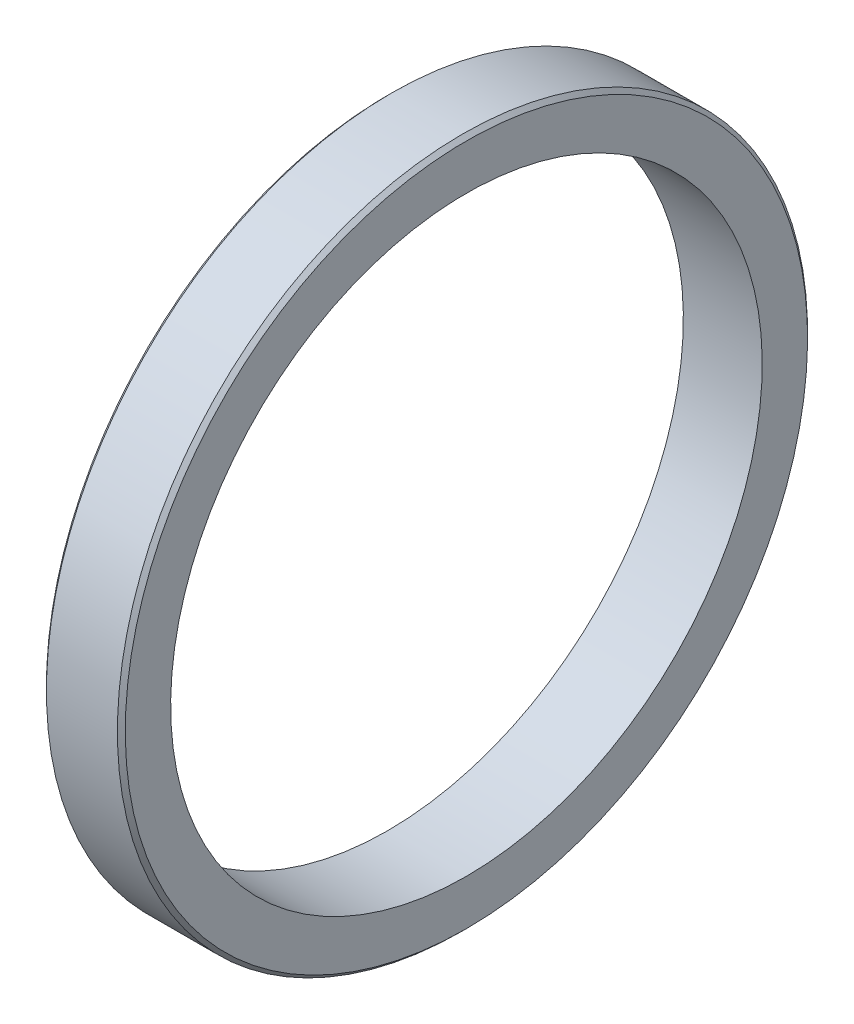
ISO-10303-21;
HEADER;
FILE_DESCRIPTION(('STEP AP214'),'2;1');
FILE_NAME('part.step','',(''),(''),'','','');
FILE_SCHEMA(('AUTOMOTIVE_DESIGN { 1 0 10303 214 1 1 1 1 }'));
ENDSEC;
DATA;
#1=APPLICATION_CONTEXT('core data for automotive mechanical design processes');
#2=APPLICATION_PROTOCOL_DEFINITION('international standard','automotive_design',2000,#1);
#3=PRODUCT_CONTEXT('',#1,'mechanical');
#4=PRODUCT('Part','Part','',(#3));
#5=PRODUCT_RELATED_PRODUCT_CATEGORY('part','',(#4));
#6=PRODUCT_DEFINITION_FORMATION('','',#4);
#7=PRODUCT_DEFINITION_CONTEXT('part definition',#1,'design');
#8=PRODUCT_DEFINITION('design','',#6,#7);
#9=PRODUCT_DEFINITION_SHAPE('','',#8);
#10=(LENGTH_UNIT() NAMED_UNIT(*) SI_UNIT(.MILLI.,.METRE.));
#11=(NAMED_UNIT(*) PLANE_ANGLE_UNIT() SI_UNIT($,.RADIAN.));
#12=(NAMED_UNIT(*) SI_UNIT($,.STERADIAN.) SOLID_ANGLE_UNIT());
#13=UNCERTAINTY_MEASURE_WITH_UNIT(LENGTH_MEASURE(1.E-05),#10,'distance_accuracy_value','');
#14=(GEOMETRIC_REPRESENTATION_CONTEXT(3) GLOBAL_UNCERTAINTY_ASSIGNED_CONTEXT((#13)) GLOBAL_UNIT_ASSIGNED_CONTEXT((#10,
#11,#12)) REPRESENTATION_CONTEXT('',''));
#15=CARTESIAN_POINT('',(0.,0.,0.));
#16=DIRECTION('',(0.,0.,1.));
#17=DIRECTION('',(1.,0.,0.));
#18=AXIS2_PLACEMENT_3D('',#15,#16,#17);
#19=CARTESIAN_POINT('',(0.200000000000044,0.,0.));
#20=DIRECTION('',(1.,0.,0.));
#21=DIRECTION('',(0.,1.,0.));
#22=AXIS2_PLACEMENT_3D('',#19,#20,#21);
#23=CONICAL_SURFACE('',#22,17.5,0.785398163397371);
#24=CARTESIAN_POINT('',(0.,0.,0.));
#25=DIRECTION('',(-1.,0.,0.));
#26=DIRECTION('',(0.,-1.,0.));
#27=AXIS2_PLACEMENT_3D('',#24,#25,#26);
#28=CIRCLE('',#27,17.3);
#29=CARTESIAN_POINT('',(0.,-17.3,0.));
#30=VERTEX_POINT('',#29);
#31=EDGE_CURVE('E53',#30,#30,#28,.T.);
#32=ORIENTED_EDGE('',*,*,#31,.F.);
#33=EDGE_LOOP('',(#32));
#34=FACE_BOUND('',#33,.T.);
#35=CARTESIAN_POINT('',(0.200000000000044,0.,0.));
#36=DIRECTION('',(-1.,0.,0.));
#37=DIRECTION('',(0.,-1.,0.));
#38=AXIS2_PLACEMENT_3D('',#35,#36,#37);
#39=CIRCLE('',#38,17.5);
#40=CARTESIAN_POINT('',(0.200000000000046,-17.5,0.));
#41=VERTEX_POINT('',#40);
#42=EDGE_CURVE('E10',#41,#41,#39,.T.);
#43=ORIENTED_EDGE('',*,*,#42,.T.);
#44=EDGE_LOOP('',(#43));
#45=FACE_BOUND('',#44,.T.);
#46=ADVANCED_FACE('F31',(#34,#45),#23,.T.);
#47=CARTESIAN_POINT('',(4.,0.,0.));
#48=DIRECTION('',(-1.,0.,0.));
#49=DIRECTION('',(0.,-1.,0.));
#50=AXIS2_PLACEMENT_3D('',#47,#48,#49);
#51=CYLINDRICAL_SURFACE('',#50,17.5);
#52=ORIENTED_EDGE('',*,*,#42,.F.);
#53=EDGE_LOOP('',(#52));
#54=FACE_BOUND('',#53,.T.);
#55=CARTESIAN_POINT('',(3.8,0.,0.));
#56=DIRECTION('',(-1.,0.,0.));
#57=DIRECTION('',(0.,-1.,0.));
#58=AXIS2_PLACEMENT_3D('',#55,#56,#57);
#59=CIRCLE('',#58,17.5);
#60=CARTESIAN_POINT('',(3.8,-17.5,0.));
#61=VERTEX_POINT('',#60);
#62=EDGE_CURVE('E37',#61,#61,#59,.T.);
#63=ORIENTED_EDGE('',*,*,#62,.T.);
#64=EDGE_LOOP('',(#63));
#65=FACE_BOUND('',#64,.T.);
#66=ADVANCED_FACE('F60',(#54,#65),#51,.T.);
#67=CARTESIAN_POINT('',(4.,0.,0.));
#68=DIRECTION('',(-1.,0.,0.));
#69=DIRECTION('',(0.,-1.,0.));
#70=AXIS2_PLACEMENT_3D('',#67,#68,#69);
#71=CONICAL_SURFACE('',#70,17.3,0.785398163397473);
#72=ORIENTED_EDGE('',*,*,#62,.F.);
#73=EDGE_LOOP('',(#72));
#74=FACE_BOUND('',#73,.T.);
#75=CARTESIAN_POINT('',(4.,0.,0.));
#76=DIRECTION('',(-1.,0.,0.));
#77=DIRECTION('',(0.,-1.,0.));
#78=AXIS2_PLACEMENT_3D('',#75,#76,#77);
#79=CIRCLE('',#78,17.3);
#80=CARTESIAN_POINT('',(4.,-17.3,0.));
#81=VERTEX_POINT('',#80);
#82=EDGE_CURVE('E41',#81,#81,#79,.T.);
#83=ORIENTED_EDGE('',*,*,#82,.T.);
#84=EDGE_LOOP('',(#83));
#85=FACE_BOUND('',#84,.T.);
#86=ADVANCED_FACE('F64',(#74,#85),#71,.T.);
#87=CARTESIAN_POINT('',(4.,15.,0.));
#88=DIRECTION('',(-1.,0.,0.));
#89=DIRECTION('',(0.,-1.,0.));
#90=AXIS2_PLACEMENT_3D('',#87,#88,#89);
#91=PLANE('',#90);
#92=ORIENTED_EDGE('',*,*,#82,.F.);
#93=EDGE_LOOP('',(#92));
#94=FACE_BOUND('',#93,.T.);
#95=CARTESIAN_POINT('',(4.,0.,0.));
#96=DIRECTION('',(-1.,0.,0.));
#97=DIRECTION('',(0.,-1.,0.));
#98=AXIS2_PLACEMENT_3D('',#95,#96,#97);
#99=CIRCLE('',#98,15.);
#100=CARTESIAN_POINT('',(4.,-15.,0.));
#101=VERTEX_POINT('',#100);
#102=EDGE_CURVE('E45',#101,#101,#99,.T.);
#103=ORIENTED_EDGE('',*,*,#102,.T.);
#104=EDGE_LOOP('',(#103));
#105=FACE_BOUND('',#104,.T.);
#106=ADVANCED_FACE('F69',(#94,#105),#91,.F.);
#107=CARTESIAN_POINT('',(4.,0.,0.));
#108=DIRECTION('',(-1.,0.,0.));
#109=DIRECTION('',(0.,-1.,0.));
#110=AXIS2_PLACEMENT_3D('',#107,#108,#109);
#111=CYLINDRICAL_SURFACE('',#110,15.);
#112=ORIENTED_EDGE('',*,*,#102,.F.);
#113=EDGE_LOOP('',(#112));
#114=FACE_BOUND('',#113,.T.);
#115=CARTESIAN_POINT('',(0.,0.,0.));
#116=DIRECTION('',(-1.,0.,0.));
#117=DIRECTION('',(0.,-1.,0.));
#118=AXIS2_PLACEMENT_3D('',#115,#116,#117);
#119=CIRCLE('',#118,15.);
#120=CARTESIAN_POINT('',(0.,-15.,0.));
#121=VERTEX_POINT('',#120);
#122=EDGE_CURVE('E50',#121,#121,#119,.T.);
#123=ORIENTED_EDGE('',*,*,#122,.T.);
#124=EDGE_LOOP('',(#123));
#125=FACE_BOUND('',#124,.T.);
#126=ADVANCED_FACE('F75',(#114,#125),#111,.F.);
#127=CARTESIAN_POINT('',(0.,17.3,0.));
#128=DIRECTION('',(1.,0.,0.));
#129=DIRECTION('',(0.,1.,0.));
#130=AXIS2_PLACEMENT_3D('',#127,#128,#129);
#131=PLANE('',#130);
#132=ORIENTED_EDGE('',*,*,#122,.F.);
#133=EDGE_LOOP('',(#132));
#134=FACE_BOUND('',#133,.T.);
#135=ORIENTED_EDGE('',*,*,#31,.T.);
#136=EDGE_LOOP('',(#135));
#137=FACE_BOUND('',#136,.T.);
#138=ADVANCED_FACE('F57',(#134,#137),#131,.F.);
#139=CLOSED_SHELL('',(#46,#66,#86,#106,#126,#138));
#140=MANIFOLD_SOLID_BREP('B2',#139);
#141=ADVANCED_BREP_SHAPE_REPRESENTATION('',(#18,#140),#14);
#142=SHAPE_DEFINITION_REPRESENTATION(#9,#141);
ENDSEC;
END-ISO-10303-21;
